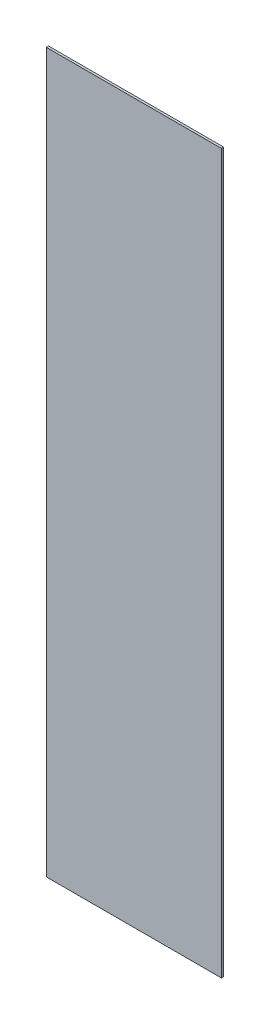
from build123d import *

# Parameters (mm, degrees)
SKETCH1_W      = 123.825
SKETCH1_H      = 508
EXTRUDE1_DEPTH = 1.5875


with BuildPart() as part:
    # Sketch1 → Extrude1 (new body)
    with BuildSketch(Plane.XY):
        with Locations((17.4625, 0)):
            Rectangle(SKETCH1_W, SKETCH1_H)
    extrude(amount=EXTRUDE1_DEPTH)


solid = part.part
